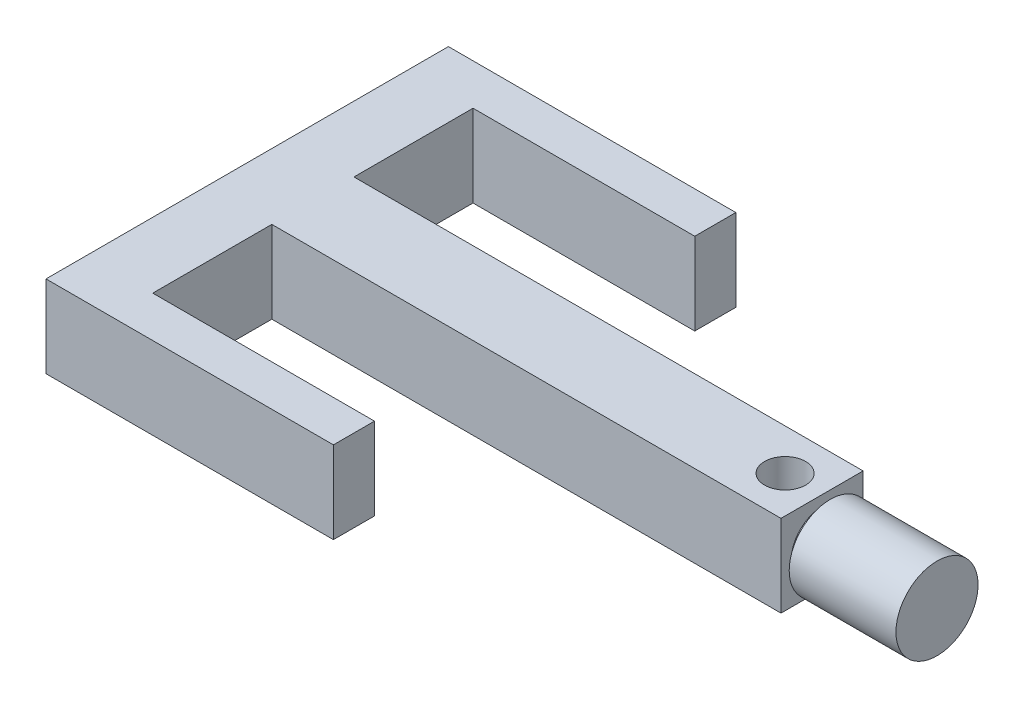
from build123d import *

# Parameters (mm, degrees)
ESTRUSIONE_ESTRUSIONE1_DEPTH = 20
SCHIZZO3_R                   = 7.5
ESTRUSIONE_ESTRUSIONE2_DEPTH = 2
SCHIZZO4_R                   = 10
ESTRUSIONE_ESTRUSIONE3_DEPTH = 26
SCHIZZO6_R                   = 5
TAGLIO_ESTRUSIONE1_DEPTH     = 23


with BuildPart() as part:
    # Schizzo2 → Estrusione-Estrusione1 (new body)
    with BuildSketch(Plane(origin=(0, 0, 0), x_dir=(1, 0, 0), z_dir=(0, 1, 0))):
        Polygon((0, 0), (0, 98), (70, 98), (70, 88), (16, 88), (16, 59), (140, 59), (140, 39), (16, 39), (16, 10), (70, 10), (70, 0), align=None)
    extrude(amount=ESTRUSIONE_ESTRUSIONE1_DEPTH)

    # Schizzo3 → Estrusione-Estrusione2 (add)
    with BuildSketch(Plane(origin=(140, 0, 0), x_dir=(0, 0, -1), z_dir=(1, 0, 0))):
        with Locations((49, 10)):
            Circle(SCHIZZO3_R)
    extrude(amount=ESTRUSIONE_ESTRUSIONE2_DEPTH)

    # Schizzo4 → Estrusione-Estrusione3 (add)
    with BuildSketch(Plane(origin=(142, 0, 0), x_dir=(0, 0, -1), z_dir=(1, 0, 0))):
        with Locations(Location((49, 10, 0), (0, 0, 180))):
            Circle(SCHIZZO4_R)
    extrude(amount=ESTRUSIONE_ESTRUSIONE3_DEPTH)

    # Schizzo6 → Taglio-Estrusione1 (cut)
    with BuildSketch(Plane(origin=(0, 20, 0), x_dir=(1, 0, 0), z_dir=(0, 1, 0))):
        with Locations(Location((131, 49, 0), (0, 0, 270))):
            Circle(SCHIZZO6_R)
    extrude(amount=-TAGLIO_ESTRUSIONE1_DEPTH, mode=Mode.SUBTRACT)


solid = part.part
